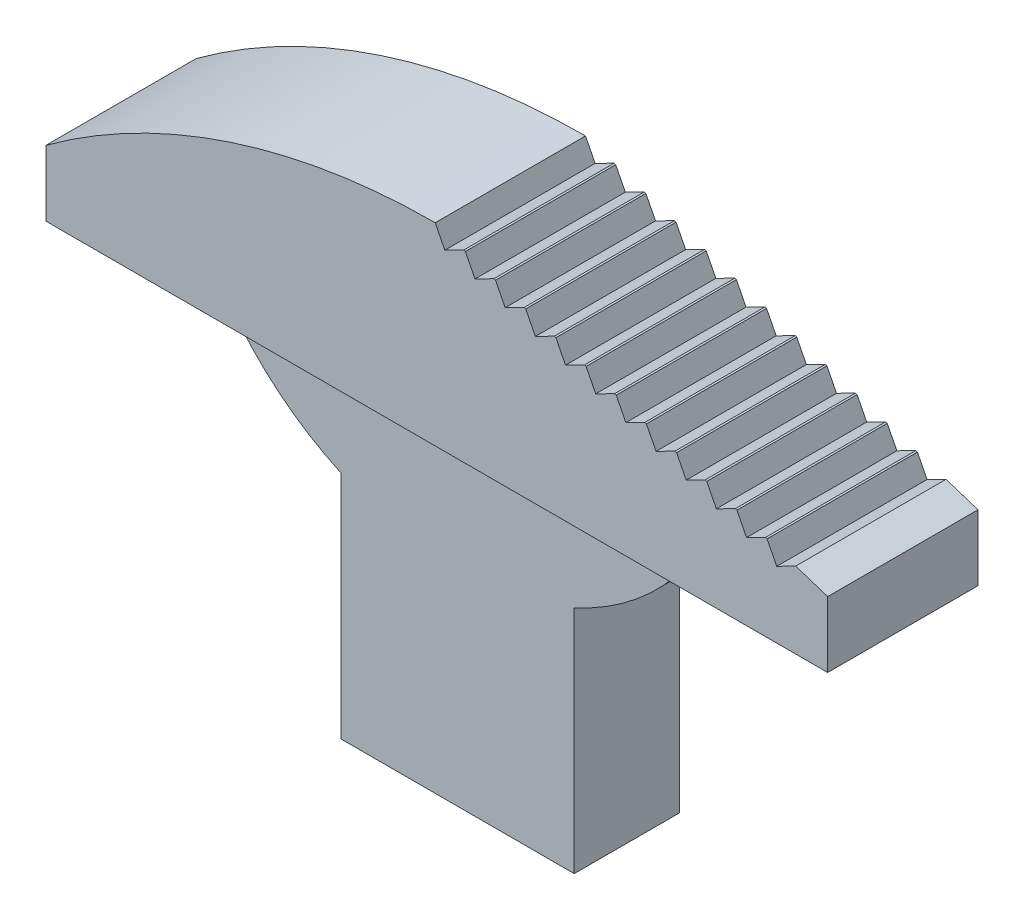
ISO-10303-21;
HEADER;
FILE_DESCRIPTION(('STEP AP214'),'2;1');
FILE_NAME('part.step','',(''),(''),'','','');
FILE_SCHEMA(('AUTOMOTIVE_DESIGN { 1 0 10303 214 1 1 1 1 }'));
ENDSEC;
DATA;
#1=APPLICATION_CONTEXT('core data for automotive mechanical design processes');
#2=APPLICATION_PROTOCOL_DEFINITION('international standard','automotive_design',2000,#1);
#3=PRODUCT_CONTEXT('',#1,'mechanical');
#4=PRODUCT('Part','Part','',(#3));
#5=PRODUCT_RELATED_PRODUCT_CATEGORY('part','',(#4));
#6=PRODUCT_DEFINITION_FORMATION('','',#4);
#7=PRODUCT_DEFINITION_CONTEXT('part definition',#1,'design');
#8=PRODUCT_DEFINITION('design','',#6,#7);
#9=PRODUCT_DEFINITION_SHAPE('','',#8);
#10=(LENGTH_UNIT() NAMED_UNIT(*) SI_UNIT(.MILLI.,.METRE.));
#11=(NAMED_UNIT(*) PLANE_ANGLE_UNIT() SI_UNIT($,.RADIAN.));
#12=(NAMED_UNIT(*) SI_UNIT($,.STERADIAN.) SOLID_ANGLE_UNIT());
#13=UNCERTAINTY_MEASURE_WITH_UNIT(LENGTH_MEASURE(1.E-05),#10,'distance_accuracy_value','');
#14=(GEOMETRIC_REPRESENTATION_CONTEXT(3) GLOBAL_UNCERTAINTY_ASSIGNED_CONTEXT((#13)) GLOBAL_UNIT_ASSIGNED_CONTEXT((#10,
#11,#12)) REPRESENTATION_CONTEXT('',''));
#15=CARTESIAN_POINT('',(0.,0.,0.));
#16=DIRECTION('',(0.,0.,1.));
#17=DIRECTION('',(1.,0.,0.));
#18=AXIS2_PLACEMENT_3D('',#15,#16,#17);
#19=CARTESIAN_POINT('',(10.5664,0.889,1.4224));
#20=DIRECTION('',(-0.309016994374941,-0.951056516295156,0.));
#21=DIRECTION('',(0.951056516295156,-0.309016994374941,0.));
#22=AXIS2_PLACEMENT_3D('',#19,#20,#21);
#23=PLANE('',#22);
#24=DIRECTION('',(0.951056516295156,-0.309016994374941,0.));
#25=VECTOR('',#24,1.);
#26=CARTESIAN_POINT('',(5.26099812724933,2.6128295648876,-0.3048));
#27=LINE('',#26,#25);
#28=CARTESIAN_POINT('',(10.1338344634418,1.0295490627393,-0.3048));
#29=VERTEX_POINT('',#28);
#30=CARTESIAN_POINT('',(10.5664,0.889,-0.3048));
#31=VERTEX_POINT('',#30);
#32=EDGE_CURVE('E350',#29,#31,#27,.T.);
#33=ORIENTED_EDGE('',*,*,#32,.F.);
#34=DIRECTION('',(0.,0.,1.));
#35=VECTOR('',#34,1.);
#36=CARTESIAN_POINT('',(10.1338344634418,1.0295490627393,-0.3048));
#37=LINE('',#36,#35);
#38=CARTESIAN_POINT('',(10.1338344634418,1.0295490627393,1.7272));
#39=VERTEX_POINT('',#38);
#40=EDGE_CURVE('E636',#29,#39,#37,.T.);
#41=ORIENTED_EDGE('',*,*,#40,.T.);
#42=DIRECTION('',(0.951056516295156,-0.309016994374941,0.));
#43=VECTOR('',#42,1.);
#44=CARTESIAN_POINT('',(5.26099812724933,2.6128295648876,1.7272));
#45=LINE('',#44,#43);
#46=CARTESIAN_POINT('',(10.5664,0.889,1.7272));
#47=VERTEX_POINT('',#46);
#48=EDGE_CURVE('E441',#39,#47,#45,.T.);
#49=ORIENTED_EDGE('',*,*,#48,.T.);
#50=DIRECTION('',(0.,0.,-1.));
#51=VECTOR('',#50,1.);
#52=CARTESIAN_POINT('',(10.5664,0.889,1.4224));
#53=LINE('',#52,#51);
#54=EDGE_CURVE('E410',#47,#31,#53,.T.);
#55=ORIENTED_EDGE('',*,*,#54,.T.);
#56=EDGE_LOOP('',(#33,#41,#49,#55));
#57=FACE_BOUND('',#56,.T.);
#58=ADVANCED_FACE('F33',(#57),#23,.F.);
#59=CARTESIAN_POINT('',(9.72598655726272,1.16206688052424,1.7272));
#60=VERTEX_POINT('',#59);
#61=CARTESIAN_POINT('',(9.74732509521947,1.15513356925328,1.7272));
#62=VERTEX_POINT('',#61);
#63=EDGE_CURVE('E342',#60,#62,#45,.T.);
#64=ORIENTED_EDGE('',*,*,#63,.T.);
#65=DIRECTION('',(0.,0.,1.));
#66=VECTOR('',#65,1.);
#67=CARTESIAN_POINT('',(9.74732509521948,1.15513356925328,-0.3048));
#68=LINE('',#67,#66);
#69=CARTESIAN_POINT('',(9.74732509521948,1.15513356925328,-0.3048));
#70=VERTEX_POINT('',#69);
#71=EDGE_CURVE('E48',#70,#62,#68,.T.);
#72=ORIENTED_EDGE('',*,*,#71,.F.);
#73=CARTESIAN_POINT('',(9.72598655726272,1.16206688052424,-0.3048));
#74=VERTEX_POINT('',#73);
#75=EDGE_CURVE('E340',#74,#70,#27,.T.);
#76=ORIENTED_EDGE('',*,*,#75,.F.);
#77=DIRECTION('',(0.,0.,1.));
#78=VECTOR('',#77,1.);
#79=CARTESIAN_POINT('',(9.72598655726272,1.16206688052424,-0.3048));
#80=LINE('',#79,#78);
#81=EDGE_CURVE('E622',#74,#60,#80,.T.);
#82=ORIENTED_EDGE('',*,*,#81,.T.);
#83=EDGE_LOOP('',(#64,#72,#76,#82));
#84=FACE_BOUND('',#83,.T.);
#85=ADVANCED_FACE('F338',(#84),#23,.F.);
#86=CARTESIAN_POINT('',(9.31813865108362,1.29458469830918,1.7272));
#87=VERTEX_POINT('',#86);
#88=CARTESIAN_POINT('',(9.33947718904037,1.28765138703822,1.7272));
#89=VERTEX_POINT('',#88);
#90=EDGE_CURVE('E720',#87,#89,#45,.T.);
#91=ORIENTED_EDGE('',*,*,#90,.T.);
#92=DIRECTION('',(0.,0.,1.));
#93=VECTOR('',#92,1.);
#94=CARTESIAN_POINT('',(9.33947718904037,1.28765138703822,-0.3048));
#95=LINE('',#94,#93);
#96=CARTESIAN_POINT('',(9.33947718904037,1.28765138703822,-0.3048));
#97=VERTEX_POINT('',#96);
#98=EDGE_CURVE('E56',#97,#89,#95,.T.);
#99=ORIENTED_EDGE('',*,*,#98,.F.);
#100=CARTESIAN_POINT('',(9.31813865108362,1.29458469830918,-0.3048));
#101=VERTEX_POINT('',#100);
#102=EDGE_CURVE('E349',#101,#97,#27,.T.);
#103=ORIENTED_EDGE('',*,*,#102,.F.);
#104=DIRECTION('',(0.,0.,1.));
#105=VECTOR('',#104,1.);
#106=CARTESIAN_POINT('',(9.31813865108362,1.29458469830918,-0.3048));
#107=LINE('',#106,#105);
#108=EDGE_CURVE('E604',#101,#87,#107,.T.);
#109=ORIENTED_EDGE('',*,*,#108,.T.);
#110=EDGE_LOOP('',(#91,#99,#103,#109));
#111=FACE_BOUND('',#110,.T.);
#112=ADVANCED_FACE('F726',(#111),#23,.F.);
#113=CARTESIAN_POINT('',(8.91029074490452,1.42710251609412,1.7272));
#114=VERTEX_POINT('',#113);
#115=CARTESIAN_POINT('',(8.93162928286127,1.42016920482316,1.7272));
#116=VERTEX_POINT('',#115);
#117=EDGE_CURVE('E712',#114,#116,#45,.T.);
#118=ORIENTED_EDGE('',*,*,#117,.T.);
#119=DIRECTION('',(0.,0.,1.));
#120=VECTOR('',#119,1.);
#121=CARTESIAN_POINT('',(8.93162928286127,1.42016920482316,-0.3048));
#122=LINE('',#121,#120);
#123=CARTESIAN_POINT('',(8.93162928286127,1.42016920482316,-0.3048));
#124=VERTEX_POINT('',#123);
#125=EDGE_CURVE('E609',#124,#116,#122,.T.);
#126=ORIENTED_EDGE('',*,*,#125,.F.);
#127=CARTESIAN_POINT('',(8.91029074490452,1.42710251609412,-0.3048));
#128=VERTEX_POINT('',#127);
#129=EDGE_CURVE('E353',#128,#124,#27,.T.);
#130=ORIENTED_EDGE('',*,*,#129,.F.);
#131=DIRECTION('',(0.,0.,1.));
#132=VECTOR('',#131,1.);
#133=CARTESIAN_POINT('',(8.91029074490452,1.42710251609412,-0.3048));
#134=LINE('',#133,#132);
#135=EDGE_CURVE('E586',#128,#114,#134,.T.);
#136=ORIENTED_EDGE('',*,*,#135,.T.);
#137=EDGE_LOOP('',(#118,#126,#130,#136));
#138=FACE_BOUND('',#137,.T.);
#139=ADVANCED_FACE('F710',(#138),#23,.F.);
#140=CARTESIAN_POINT('',(8.50244283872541,1.55962033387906,1.7272));
#141=VERTEX_POINT('',#140);
#142=CARTESIAN_POINT('',(8.52378137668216,1.55268702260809,1.7272));
#143=VERTEX_POINT('',#142);
#144=EDGE_CURVE('E732',#141,#143,#45,.T.);
#145=ORIENTED_EDGE('',*,*,#144,.T.);
#146=DIRECTION('',(0.,0.,1.));
#147=VECTOR('',#146,1.);
#148=CARTESIAN_POINT('',(8.52378137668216,1.55268702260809,-0.3048));
#149=LINE('',#148,#147);
#150=CARTESIAN_POINT('',(8.52378137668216,1.55268702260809,-0.3048));
#151=VERTEX_POINT('',#150);
#152=EDGE_CURVE('E591',#151,#143,#149,.T.);
#153=ORIENTED_EDGE('',*,*,#152,.F.);
#154=CARTESIAN_POINT('',(8.50244283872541,1.55962033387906,-0.3048));
#155=VERTEX_POINT('',#154);
#156=EDGE_CURVE('E700',#155,#151,#27,.T.);
#157=ORIENTED_EDGE('',*,*,#156,.F.);
#158=DIRECTION('',(0.,0.,1.));
#159=VECTOR('',#158,1.);
#160=CARTESIAN_POINT('',(8.50244283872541,1.55962033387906,-0.3048));
#161=LINE('',#160,#159);
#162=EDGE_CURVE('E568',#155,#141,#161,.T.);
#163=ORIENTED_EDGE('',*,*,#162,.T.);
#164=EDGE_LOOP('',(#145,#153,#157,#163));
#165=FACE_BOUND('',#164,.T.);
#166=ADVANCED_FACE('F803',(#165),#23,.F.);
#167=CARTESIAN_POINT('',(8.09459493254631,1.69213815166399,1.7272));
#168=VERTEX_POINT('',#167);
#169=CARTESIAN_POINT('',(8.11593347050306,1.68520484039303,1.7272));
#170=VERTEX_POINT('',#169);
#171=EDGE_CURVE('E734',#168,#170,#45,.T.);
#172=ORIENTED_EDGE('',*,*,#171,.T.);
#173=DIRECTION('',(0.,0.,1.));
#174=VECTOR('',#173,1.);
#175=CARTESIAN_POINT('',(8.11593347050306,1.68520484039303,-0.3048));
#176=LINE('',#175,#174);
#177=CARTESIAN_POINT('',(8.11593347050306,1.68520484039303,-0.3048));
#178=VERTEX_POINT('',#177);
#179=EDGE_CURVE('E573',#178,#170,#176,.T.);
#180=ORIENTED_EDGE('',*,*,#179,.F.);
#181=CARTESIAN_POINT('',(8.09459493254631,1.69213815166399,-0.3048));
#182=VERTEX_POINT('',#181);
#183=EDGE_CURVE('E697',#182,#178,#27,.T.);
#184=ORIENTED_EDGE('',*,*,#183,.F.);
#185=DIRECTION('',(0.,0.,1.));
#186=VECTOR('',#185,1.);
#187=CARTESIAN_POINT('',(8.09459493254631,1.69213815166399,-0.3048));
#188=LINE('',#187,#186);
#189=EDGE_CURVE('E550',#182,#168,#188,.T.);
#190=ORIENTED_EDGE('',*,*,#189,.T.);
#191=EDGE_LOOP('',(#172,#180,#184,#190));
#192=FACE_BOUND('',#191,.T.);
#193=ADVANCED_FACE('F795',(#192),#23,.F.);
#194=CARTESIAN_POINT('',(7.6867470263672,1.82465596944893,1.7272));
#195=VERTEX_POINT('',#194);
#196=CARTESIAN_POINT('',(7.70808556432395,1.81772265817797,1.7272));
#197=VERTEX_POINT('',#196);
#198=EDGE_CURVE('E739',#195,#197,#45,.T.);
#199=ORIENTED_EDGE('',*,*,#198,.T.);
#200=DIRECTION('',(0.,0.,1.));
#201=VECTOR('',#200,1.);
#202=CARTESIAN_POINT('',(7.70808556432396,1.81772265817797,-0.3048));
#203=LINE('',#202,#201);
#204=CARTESIAN_POINT('',(7.70808556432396,1.81772265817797,-0.3048));
#205=VERTEX_POINT('',#204);
#206=EDGE_CURVE('E555',#205,#197,#203,.T.);
#207=ORIENTED_EDGE('',*,*,#206,.F.);
#208=CARTESIAN_POINT('',(7.6867470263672,1.82465596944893,-0.3048));
#209=VERTEX_POINT('',#208);
#210=EDGE_CURVE('E694',#209,#205,#27,.T.);
#211=ORIENTED_EDGE('',*,*,#210,.F.);
#212=DIRECTION('',(0.,0.,1.));
#213=VECTOR('',#212,1.);
#214=CARTESIAN_POINT('',(7.6867470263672,1.82465596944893,-0.3048));
#215=LINE('',#214,#213);
#216=EDGE_CURVE('E532',#209,#195,#215,.T.);
#217=ORIENTED_EDGE('',*,*,#216,.T.);
#218=EDGE_LOOP('',(#199,#207,#211,#217));
#219=FACE_BOUND('',#218,.T.);
#220=ADVANCED_FACE('F787',(#219),#23,.F.);
#221=CARTESIAN_POINT('',(7.2788991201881,1.95717378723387,1.7272));
#222=VERTEX_POINT('',#221);
#223=CARTESIAN_POINT('',(7.30023765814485,1.95024047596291,1.7272));
#224=VERTEX_POINT('',#223);
#225=EDGE_CURVE('E744',#222,#224,#45,.T.);
#226=ORIENTED_EDGE('',*,*,#225,.T.);
#227=DIRECTION('',(0.,0.,1.));
#228=VECTOR('',#227,1.);
#229=CARTESIAN_POINT('',(7.30023765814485,1.95024047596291,-0.3048));
#230=LINE('',#229,#228);
#231=CARTESIAN_POINT('',(7.30023765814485,1.95024047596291,-0.3048));
#232=VERTEX_POINT('',#231);
#233=EDGE_CURVE('E537',#232,#224,#230,.T.);
#234=ORIENTED_EDGE('',*,*,#233,.F.);
#235=CARTESIAN_POINT('',(7.2788991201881,1.95717378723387,-0.3048));
#236=VERTEX_POINT('',#235);
#237=EDGE_CURVE('E691',#236,#232,#27,.T.);
#238=ORIENTED_EDGE('',*,*,#237,.F.);
#239=DIRECTION('',(0.,0.,1.));
#240=VECTOR('',#239,1.);
#241=CARTESIAN_POINT('',(7.2788991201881,1.95717378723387,-0.3048));
#242=LINE('',#241,#240);
#243=EDGE_CURVE('E514',#236,#222,#242,.T.);
#244=ORIENTED_EDGE('',*,*,#243,.T.);
#245=EDGE_LOOP('',(#226,#234,#238,#244));
#246=FACE_BOUND('',#245,.T.);
#247=ADVANCED_FACE('F779',(#246),#23,.F.);
#248=CARTESIAN_POINT('',(6.87105121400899,2.08969160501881,1.7272));
#249=VERTEX_POINT('',#248);
#250=CARTESIAN_POINT('',(6.89238975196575,2.08275829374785,1.7272));
#251=VERTEX_POINT('',#250);
#252=EDGE_CURVE('E749',#249,#251,#45,.T.);
#253=ORIENTED_EDGE('',*,*,#252,.T.);
#254=DIRECTION('',(0.,0.,1.));
#255=VECTOR('',#254,1.);
#256=CARTESIAN_POINT('',(6.89238975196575,2.08275829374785,-0.3048));
#257=LINE('',#256,#255);
#258=CARTESIAN_POINT('',(6.89238975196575,2.08275829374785,-0.3048));
#259=VERTEX_POINT('',#258);
#260=EDGE_CURVE('E519',#259,#251,#257,.T.);
#261=ORIENTED_EDGE('',*,*,#260,.F.);
#262=CARTESIAN_POINT('',(6.87105121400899,2.08969160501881,-0.3048));
#263=VERTEX_POINT('',#262);
#264=EDGE_CURVE('E688',#263,#259,#27,.T.);
#265=ORIENTED_EDGE('',*,*,#264,.F.);
#266=DIRECTION('',(0.,0.,1.));
#267=VECTOR('',#266,1.);
#268=CARTESIAN_POINT('',(6.87105121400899,2.08969160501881,-0.3048));
#269=LINE('',#268,#267);
#270=EDGE_CURVE('E496',#263,#249,#269,.T.);
#271=ORIENTED_EDGE('',*,*,#270,.T.);
#272=EDGE_LOOP('',(#253,#261,#265,#271));
#273=FACE_BOUND('',#272,.T.);
#274=ADVANCED_FACE('F770',(#273),#23,.F.);
#275=CARTESIAN_POINT('',(6.46320330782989,2.22220942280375,1.7272));
#276=VERTEX_POINT('',#275);
#277=CARTESIAN_POINT('',(6.48454184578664,2.21527611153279,1.7272));
#278=VERTEX_POINT('',#277);
#279=EDGE_CURVE('E754',#276,#278,#45,.T.);
#280=ORIENTED_EDGE('',*,*,#279,.T.);
#281=DIRECTION('',(0.,0.,1.));
#282=VECTOR('',#281,1.);
#283=CARTESIAN_POINT('',(6.48454184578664,2.21527611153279,-0.3048));
#284=LINE('',#283,#282);
#285=CARTESIAN_POINT('',(6.48454184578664,2.21527611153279,-0.3048));
#286=VERTEX_POINT('',#285);
#287=EDGE_CURVE('E501',#286,#278,#284,.T.);
#288=ORIENTED_EDGE('',*,*,#287,.F.);
#289=CARTESIAN_POINT('',(6.46320330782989,2.22220942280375,-0.3048));
#290=VERTEX_POINT('',#289);
#291=EDGE_CURVE('E686',#290,#286,#27,.T.);
#292=ORIENTED_EDGE('',*,*,#291,.F.);
#293=DIRECTION('',(0.,0.,1.));
#294=VECTOR('',#293,1.);
#295=CARTESIAN_POINT('',(6.46320330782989,2.22220942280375,-0.3048));
#296=LINE('',#295,#294);
#297=EDGE_CURVE('E478',#290,#276,#296,.T.);
#298=ORIENTED_EDGE('',*,*,#297,.T.);
#299=EDGE_LOOP('',(#280,#288,#292,#298));
#300=FACE_BOUND('',#299,.T.);
#301=ADVANCED_FACE('F762',(#300),#23,.F.);
#302=CARTESIAN_POINT('',(6.05535540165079,2.35472724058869,1.7272));
#303=VERTEX_POINT('',#302);
#304=CARTESIAN_POINT('',(6.07669393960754,2.34779392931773,1.7272));
#305=VERTEX_POINT('',#304);
#306=EDGE_CURVE('E440',#303,#305,#45,.T.);
#307=ORIENTED_EDGE('',*,*,#306,.T.);
#308=DIRECTION('',(0.,0.,1.));
#309=VECTOR('',#308,1.);
#310=CARTESIAN_POINT('',(6.07669393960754,2.34779392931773,-0.3048));
#311=LINE('',#310,#309);
#312=CARTESIAN_POINT('',(6.07669393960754,2.34779392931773,-0.3048));
#313=VERTEX_POINT('',#312);
#314=EDGE_CURVE('E483',#313,#305,#311,.T.);
#315=ORIENTED_EDGE('',*,*,#314,.F.);
#316=CARTESIAN_POINT('',(6.05535540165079,2.35472724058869,-0.3048));
#317=VERTEX_POINT('',#316);
#318=EDGE_CURVE('E360',#317,#313,#27,.T.);
#319=ORIENTED_EDGE('',*,*,#318,.F.);
#320=DIRECTION('',(0.,0.,1.));
#321=VECTOR('',#320,1.);
#322=CARTESIAN_POINT('',(6.05535540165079,2.35472724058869,-0.3048));
#323=LINE('',#322,#321);
#324=EDGE_CURVE('E461',#317,#303,#323,.T.);
#325=ORIENTED_EDGE('',*,*,#324,.T.);
#326=EDGE_LOOP('',(#307,#315,#319,#325));
#327=FACE_BOUND('',#326,.T.);
#328=ADVANCED_FACE('F683',(#327),#23,.F.);
#329=CARTESIAN_POINT('',(0.,0.,1.4224));
#330=DIRECTION('',(-1.,0.,0.));
#331=DIRECTION('',(0.,0.,1.));
#332=AXIS2_PLACEMENT_3D('',#329,#330,#331);
#333=PLANE('',#332);
#334=DIRECTION('',(0.,0.,-1.));
#335=VECTOR('',#334,1.);
#336=CARTESIAN_POINT('',(0.,0.889000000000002,1.4224));
#337=LINE('',#336,#335);
#338=CARTESIAN_POINT('',(0.,0.889000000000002,1.7272));
#339=VERTEX_POINT('',#338);
#340=CARTESIAN_POINT('',(0.,0.889000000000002,-0.3048));
#341=VERTEX_POINT('',#340);
#342=EDGE_CURVE('E379',#339,#341,#337,.T.);
#343=ORIENTED_EDGE('',*,*,#342,.T.);
#344=DIRECTION('',(0.,1.,0.));
#345=VECTOR('',#344,1.);
#346=CARTESIAN_POINT('',(0.,0.,-0.3048));
#347=LINE('',#346,#345);
#348=CARTESIAN_POINT('',(0.,0.,-0.3048));
#349=VERTEX_POINT('',#348);
#350=EDGE_CURVE('E420',#349,#341,#347,.T.);
#351=ORIENTED_EDGE('',*,*,#350,.F.);
#352=DIRECTION('',(0.,0.,-1.));
#353=VECTOR('',#352,1.);
#354=CARTESIAN_POINT('',(0.,0.,1.4224));
#355=LINE('',#354,#353);
#356=CARTESIAN_POINT('',(0.,0.,1.7272));
#357=VERTEX_POINT('',#356);
#358=EDGE_CURVE('E41',#357,#349,#355,.T.);
#359=ORIENTED_EDGE('',*,*,#358,.F.);
#360=DIRECTION('',(0.,1.,0.));
#361=VECTOR('',#360,1.);
#362=CARTESIAN_POINT('',(0.,0.,1.7272));
#363=LINE('',#362,#361);
#364=EDGE_CURVE('E423',#357,#339,#363,.T.);
#365=ORIENTED_EDGE('',*,*,#364,.T.);
#366=EDGE_LOOP('',(#343,#351,#359,#365));
#367=FACE_BOUND('',#366,.T.);
#368=ADVANCED_FACE('F35',(#367),#333,.T.);
#369=CARTESIAN_POINT('',(0.,0.,1.4224));
#370=DIRECTION('',(0.,1.,0.));
#371=DIRECTION('',(0.,0.,1.));
#372=AXIS2_PLACEMENT_3D('',#369,#370,#371);
#373=PLANE('',#372);
#374=DIRECTION('',(0.,0.,-1.));
#375=VECTOR('',#374,1.);
#376=CARTESIAN_POINT('',(10.5664,0.,1.4224));
#377=LINE('',#376,#375);
#378=CARTESIAN_POINT('',(10.5664,0.,1.7272));
#379=VERTEX_POINT('',#378);
#380=CARTESIAN_POINT('',(10.5664,0.,-0.3048));
#381=VERTEX_POINT('',#380);
#382=EDGE_CURVE('E408',#379,#381,#377,.T.);
#383=ORIENTED_EDGE('',*,*,#382,.F.);
#384=DIRECTION('',(-1.,0.,0.));
#385=VECTOR('',#384,1.);
#386=CARTESIAN_POINT('',(10.5664,0.,1.7272));
#387=LINE('',#386,#385);
#388=EDGE_CURVE('E445',#379,#357,#387,.T.);
#389=ORIENTED_EDGE('',*,*,#388,.T.);
#390=ORIENTED_EDGE('',*,*,#358,.T.);
#391=DIRECTION('',(-1.,0.,0.));
#392=VECTOR('',#391,1.);
#393=CARTESIAN_POINT('',(10.5664,0.,-0.3048));
#394=LINE('',#393,#392);
#395=EDGE_CURVE('E432',#381,#349,#394,.T.);
#396=ORIENTED_EDGE('',*,*,#395,.F.);
#397=EDGE_LOOP('',(#383,#389,#390,#396));
#398=FACE_BOUND('',#397,.T.);
#399=DIRECTION('',(-1.,0.,0.));
#400=VECTOR('',#399,1.);
#401=CARTESIAN_POINT('',(5.26099812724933,0.,1.4224));
#402=LINE('',#401,#400);
#403=CARTESIAN_POINT('',(8.36468689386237,0.,1.4224));
#404=VERTEX_POINT('',#403);
#405=CARTESIAN_POINT('',(2.15730936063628,0.,1.4224));
#406=VERTEX_POINT('',#405);
#407=EDGE_CURVE('E362',#404,#406,#402,.T.);
#408=ORIENTED_EDGE('',*,*,#407,.F.);
#409=DIRECTION('',(0.,0.,-1.));
#410=VECTOR('',#409,1.);
#411=CARTESIAN_POINT('',(8.36468689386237,0.,1.4224));
#412=LINE('',#411,#410);
#413=CARTESIAN_POINT('',(8.36468689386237,0.,0.));
#414=VERTEX_POINT('',#413);
#415=EDGE_CURVE('E405',#404,#414,#412,.T.);
#416=ORIENTED_EDGE('',*,*,#415,.T.);
#417=DIRECTION('',(-1.,0.,0.));
#418=VECTOR('',#417,1.);
#419=CARTESIAN_POINT('',(5.26099812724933,0.,0.));
#420=LINE('',#419,#418);
#421=CARTESIAN_POINT('',(2.15730936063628,0.,0.));
#422=VERTEX_POINT('',#421);
#423=EDGE_CURVE('E11',#414,#422,#420,.T.);
#424=ORIENTED_EDGE('',*,*,#423,.T.);
#425=DIRECTION('',(0.,0.,-1.));
#426=VECTOR('',#425,1.);
#427=CARTESIAN_POINT('',(2.15730936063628,0.,1.4224));
#428=LINE('',#427,#426);
#429=EDGE_CURVE('E392',#406,#422,#428,.T.);
#430=ORIENTED_EDGE('',*,*,#429,.F.);
#431=EDGE_LOOP('',(#408,#416,#424,#430));
#432=FACE_BOUND('',#431,.T.);
#433=ADVANCED_FACE('F656',(#398,#432),#373,.F.);
#434=CARTESIAN_POINT('',(5.26099812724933,2.2098,1.4224));
#435=DIRECTION('',(0.,0.,-1.));
#436=DIRECTION('',(-1.,0.,0.));
#437=AXIS2_PLACEMENT_3D('',#434,#435,#436);
#438=CYLINDRICAL_SURFACE('',#437,3.81);
#439=CARTESIAN_POINT('',(5.26099812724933,2.2098,0.));
#440=DIRECTION('',(0.,0.,1.));
#441=DIRECTION('',(1.,0.,0.));
#442=AXIS2_PLACEMENT_3D('',#439,#440,#441);
#443=CIRCLE('',#442,3.81);
#444=CARTESIAN_POINT('',(3.68619812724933,-1.25950900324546,0.));
#445=VERTEX_POINT('',#444);
#446=EDGE_CURVE('E370',#422,#445,#443,.T.);
#447=ORIENTED_EDGE('',*,*,#446,.T.);
#448=DIRECTION('',(0.,0.,-1.));
#449=VECTOR('',#448,1.);
#450=CARTESIAN_POINT('',(3.68619812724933,-1.25950900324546,1.4224));
#451=LINE('',#450,#449);
#452=CARTESIAN_POINT('',(3.68619812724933,-1.25950900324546,1.4224));
#453=VERTEX_POINT('',#452);
#454=EDGE_CURVE('E395',#453,#445,#451,.T.);
#455=ORIENTED_EDGE('',*,*,#454,.F.);
#456=CARTESIAN_POINT('',(5.26099812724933,2.2098,1.4224));
#457=DIRECTION('',(0.,0.,1.));
#458=DIRECTION('',(1.,0.,0.));
#459=AXIS2_PLACEMENT_3D('',#456,#457,#458);
#460=CIRCLE('',#459,3.81);
#461=EDGE_CURVE('E377',#406,#453,#460,.T.);
#462=ORIENTED_EDGE('',*,*,#461,.F.);
#463=ORIENTED_EDGE('',*,*,#429,.T.);
#464=EDGE_LOOP('',(#447,#455,#462,#463));
#465=FACE_BOUND('',#464,.T.);
#466=ADVANCED_FACE('F917',(#465),#438,.T.);
#467=CARTESIAN_POINT('',(3.68619812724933,-4.3721704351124,1.4224));
#468=DIRECTION('',(-1.,0.,0.));
#469=DIRECTION('',(0.,0.,1.));
#470=AXIS2_PLACEMENT_3D('',#467,#468,#469);
#471=PLANE('',#470);
#472=DIRECTION('',(0.,1.,0.));
#473=VECTOR('',#472,1.);
#474=CARTESIAN_POINT('',(3.68619812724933,-4.3721704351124,0.));
#475=LINE('',#474,#473);
#476=CARTESIAN_POINT('',(3.68619812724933,-4.3721704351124,0.));
#477=VERTEX_POINT('',#476);
#478=EDGE_CURVE('E386',#477,#445,#475,.T.);
#479=ORIENTED_EDGE('',*,*,#478,.F.);
#480=DIRECTION('',(0.,0.,-1.));
#481=VECTOR('',#480,1.);
#482=CARTESIAN_POINT('',(3.68619812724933,-4.3721704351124,1.4224));
#483=LINE('',#482,#481);
#484=CARTESIAN_POINT('',(3.68619812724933,-4.3721704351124,1.4224));
#485=VERTEX_POINT('',#484);
#486=EDGE_CURVE('E397',#485,#477,#483,.T.);
#487=ORIENTED_EDGE('',*,*,#486,.F.);
#488=DIRECTION('',(0.,1.,0.));
#489=VECTOR('',#488,1.);
#490=CARTESIAN_POINT('',(3.68619812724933,-4.3721704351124,1.4224));
#491=LINE('',#490,#489);
#492=EDGE_CURVE('E374',#485,#453,#491,.T.);
#493=ORIENTED_EDGE('',*,*,#492,.T.);
#494=ORIENTED_EDGE('',*,*,#454,.T.);
#495=EDGE_LOOP('',(#479,#487,#493,#494));
#496=FACE_BOUND('',#495,.T.);
#497=ADVANCED_FACE('F922',(#496),#471,.T.);
#498=CARTESIAN_POINT('',(3.68619812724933,-4.3721704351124,1.4224));
#499=DIRECTION('',(0.,1.,0.));
#500=DIRECTION('',(0.,0.,1.));
#501=AXIS2_PLACEMENT_3D('',#498,#499,#500);
#502=PLANE('',#501);
#503=DIRECTION('',(1.,0.,0.));
#504=VECTOR('',#503,1.);
#505=CARTESIAN_POINT('',(3.68619812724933,-4.3721704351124,0.));
#506=LINE('',#505,#504);
#507=CARTESIAN_POINT('',(6.83579812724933,-4.3721704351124,0.));
#508=VERTEX_POINT('',#507);
#509=EDGE_CURVE('E384',#477,#508,#506,.T.);
#510=ORIENTED_EDGE('',*,*,#509,.T.);
#511=DIRECTION('',(0.,0.,-1.));
#512=VECTOR('',#511,1.);
#513=CARTESIAN_POINT('',(6.83579812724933,-4.3721704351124,1.4224));
#514=LINE('',#513,#512);
#515=CARTESIAN_POINT('',(6.83579812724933,-4.3721704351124,1.4224));
#516=VERTEX_POINT('',#515);
#517=EDGE_CURVE('E399',#516,#508,#514,.T.);
#518=ORIENTED_EDGE('',*,*,#517,.F.);
#519=DIRECTION('',(1.,0.,0.));
#520=VECTOR('',#519,1.);
#521=CARTESIAN_POINT('',(3.68619812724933,-4.3721704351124,1.4224));
#522=LINE('',#521,#520);
#523=EDGE_CURVE('E372',#485,#516,#522,.T.);
#524=ORIENTED_EDGE('',*,*,#523,.F.);
#525=ORIENTED_EDGE('',*,*,#486,.T.);
#526=EDGE_LOOP('',(#510,#518,#524,#525));
#527=FACE_BOUND('',#526,.T.);
#528=ADVANCED_FACE('F947',(#527),#502,.F.);
#529=CARTESIAN_POINT('',(6.83579812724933,-4.3721704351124,1.4224));
#530=DIRECTION('',(-1.,0.,0.));
#531=DIRECTION('',(0.,0.,1.));
#532=AXIS2_PLACEMENT_3D('',#529,#530,#531);
#533=PLANE('',#532);
#534=DIRECTION('',(0.,1.,0.));
#535=VECTOR('',#534,1.);
#536=CARTESIAN_POINT('',(6.83579812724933,-4.3721704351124,0.));
#537=LINE('',#536,#535);
#538=CARTESIAN_POINT('',(6.83579812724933,-1.25950900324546,0.));
#539=VERTEX_POINT('',#538);
#540=EDGE_CURVE('E382',#508,#539,#537,.T.);
#541=ORIENTED_EDGE('',*,*,#540,.T.);
#542=DIRECTION('',(0.,0.,-1.));
#543=VECTOR('',#542,1.);
#544=CARTESIAN_POINT('',(6.83579812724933,-1.25950900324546,1.4224));
#545=LINE('',#544,#543);
#546=CARTESIAN_POINT('',(6.83579812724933,-1.25950900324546,1.4224));
#547=VERTEX_POINT('',#546);
#548=EDGE_CURVE('E402',#547,#539,#545,.T.);
#549=ORIENTED_EDGE('',*,*,#548,.F.);
#550=DIRECTION('',(0.,1.,0.));
#551=VECTOR('',#550,1.);
#552=CARTESIAN_POINT('',(6.83579812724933,-4.3721704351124,1.4224));
#553=LINE('',#552,#551);
#554=EDGE_CURVE('E369',#516,#547,#553,.T.);
#555=ORIENTED_EDGE('',*,*,#554,.F.);
#556=ORIENTED_EDGE('',*,*,#517,.T.);
#557=EDGE_LOOP('',(#541,#549,#555,#556));
#558=FACE_BOUND('',#557,.T.);
#559=ADVANCED_FACE('F909',(#558),#533,.F.);
#560=CARTESIAN_POINT('',(5.26099812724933,2.2098,1.4224));
#561=DIRECTION('',(0.,0.,-1.));
#562=DIRECTION('',(-1.,0.,0.));
#563=AXIS2_PLACEMENT_3D('',#560,#561,#562);
#564=CYLINDRICAL_SURFACE('',#563,3.81);
#565=CARTESIAN_POINT('',(5.26099812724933,2.2098,0.));
#566=DIRECTION('',(0.,0.,1.));
#567=DIRECTION('',(1.,0.,0.));
#568=AXIS2_PLACEMENT_3D('',#565,#566,#567);
#569=CIRCLE('',#568,3.81);
#570=EDGE_CURVE('E365',#539,#414,#569,.T.);
#571=ORIENTED_EDGE('',*,*,#570,.T.);
#572=ORIENTED_EDGE('',*,*,#415,.F.);
#573=CARTESIAN_POINT('',(5.26099812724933,2.2098,1.4224));
#574=DIRECTION('',(0.,0.,1.));
#575=DIRECTION('',(1.,0.,0.));
#576=AXIS2_PLACEMENT_3D('',#573,#574,#575);
#577=CIRCLE('',#576,3.81);
#578=EDGE_CURVE('E367',#547,#404,#577,.T.);
#579=ORIENTED_EDGE('',*,*,#578,.F.);
#580=ORIENTED_EDGE('',*,*,#548,.T.);
#581=EDGE_LOOP('',(#571,#572,#579,#580));
#582=FACE_BOUND('',#581,.T.);
#583=ADVANCED_FACE('F829',(#582),#564,.T.);
#584=CARTESIAN_POINT('',(10.5664,0.,1.4224));
#585=DIRECTION('',(-1.,0.,0.));
#586=DIRECTION('',(0.,0.,1.));
#587=AXIS2_PLACEMENT_3D('',#584,#585,#586);
#588=PLANE('',#587);
#589=ORIENTED_EDGE('',*,*,#382,.T.);
#590=DIRECTION('',(0.,-1.,0.));
#591=VECTOR('',#590,1.);
#592=CARTESIAN_POINT('',(10.5664,0.889,-0.3048));
#593=LINE('',#592,#591);
#594=EDGE_CURVE('E433',#31,#381,#593,.T.);
#595=ORIENTED_EDGE('',*,*,#594,.F.);
#596=ORIENTED_EDGE('',*,*,#54,.F.);
#597=DIRECTION('',(0.,-1.,0.));
#598=VECTOR('',#597,1.);
#599=CARTESIAN_POINT('',(10.5664,0.889,1.7272));
#600=LINE('',#599,#598);
#601=EDGE_CURVE('E359',#47,#379,#600,.T.);
#602=ORIENTED_EDGE('',*,*,#601,.T.);
#603=EDGE_LOOP('',(#589,#595,#596,#602));
#604=FACE_BOUND('',#603,.T.);
#605=ADVANCED_FACE('F653',(#604),#588,.F.);
#606=CARTESIAN_POINT('',(5.64750749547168,2.48724505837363,1.7272));
#607=VERTEX_POINT('',#606);
#608=CARTESIAN_POINT('',(5.66884603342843,2.48031174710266,1.7272));
#609=VERTEX_POINT('',#608);
#610=EDGE_CURVE('E366',#607,#609,#45,.T.);
#611=ORIENTED_EDGE('',*,*,#610,.T.);
#612=DIRECTION('',(0.,0.,1.));
#613=VECTOR('',#612,1.);
#614=CARTESIAN_POINT('',(5.66884603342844,2.48031174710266,-0.3048));
#615=LINE('',#614,#613);
#616=CARTESIAN_POINT('',(5.66884603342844,2.48031174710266,-0.3048));
#617=VERTEX_POINT('',#616);
#618=EDGE_CURVE('E465',#617,#609,#615,.T.);
#619=ORIENTED_EDGE('',*,*,#618,.F.);
#620=CARTESIAN_POINT('',(5.64750749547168,2.48724505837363,-0.3048));
#621=VERTEX_POINT('',#620);
#622=EDGE_CURVE('E355',#621,#617,#27,.T.);
#623=ORIENTED_EDGE('',*,*,#622,.F.);
#624=DIRECTION('',(0.,0.,1.));
#625=VECTOR('',#624,1.);
#626=CARTESIAN_POINT('',(5.64750749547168,2.48724505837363,-0.3048));
#627=LINE('',#626,#625);
#628=EDGE_CURVE('E437',#621,#607,#627,.T.);
#629=ORIENTED_EDGE('',*,*,#628,.T.);
#630=EDGE_LOOP('',(#611,#619,#623,#629));
#631=FACE_BOUND('',#630,.T.);
#632=ADVANCED_FACE('F670',(#631),#23,.F.);
#633=CARTESIAN_POINT('',(5.26099812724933,-6.2771704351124,1.4224));
#634=DIRECTION('',(0.,0.,-1.));
#635=DIRECTION('',(-1.,0.,0.));
#636=AXIS2_PLACEMENT_3D('',#633,#634,#635);
#637=CYLINDRICAL_SURFACE('',#636,8.89);
#638=DIRECTION('',(0.,0.,-1.));
#639=VECTOR('',#638,1.);
#640=CARTESIAN_POINT('',(5.26099812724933,2.6128295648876,1.4224));
#641=LINE('',#640,#639);
#642=CARTESIAN_POINT('',(5.26099812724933,2.6128295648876,1.7272));
#643=VERTEX_POINT('',#642);
#644=CARTESIAN_POINT('',(5.26099812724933,2.6128295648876,-0.3048));
#645=VERTEX_POINT('',#644);
#646=EDGE_CURVE('E413',#643,#645,#641,.T.);
#647=ORIENTED_EDGE('',*,*,#646,.T.);
#648=CARTESIAN_POINT('',(5.26099812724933,-6.2771704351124,-0.3048));
#649=DIRECTION('',(0.,0.,-1.));
#650=DIRECTION('',(-1.,0.,0.));
#651=AXIS2_PLACEMENT_3D('',#648,#649,#650);
#652=CIRCLE('',#651,8.89);
#653=EDGE_CURVE('E354',#341,#645,#652,.T.);
#654=ORIENTED_EDGE('',*,*,#653,.F.);
#655=ORIENTED_EDGE('',*,*,#342,.F.);
#656=CARTESIAN_POINT('',(5.26099812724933,-6.2771704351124,1.7272));
#657=DIRECTION('',(0.,0.,-1.));
#658=DIRECTION('',(-1.,0.,0.));
#659=AXIS2_PLACEMENT_3D('',#656,#657,#658);
#660=CIRCLE('',#659,8.89);
#661=EDGE_CURVE('E442',#339,#643,#660,.T.);
#662=ORIENTED_EDGE('',*,*,#661,.T.);
#663=EDGE_LOOP('',(#647,#654,#655,#662));
#664=FACE_BOUND('',#663,.T.);
#665=ADVANCED_FACE('F428',(#664),#637,.T.);
#666=CARTESIAN_POINT('',(5.26099812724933,-6.2771704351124,1.4224));
#667=DIRECTION('',(0.,0.,-1.));
#668=DIRECTION('',(-1.,0.,0.));
#669=AXIS2_PLACEMENT_3D('',#666,#667,#668);
#670=PLANE('',#669);
#671=ORIENTED_EDGE('',*,*,#578,.T.);
#672=ORIENTED_EDGE('',*,*,#407,.T.);
#673=ORIENTED_EDGE('',*,*,#461,.T.);
#674=ORIENTED_EDGE('',*,*,#492,.F.);
#675=ORIENTED_EDGE('',*,*,#523,.T.);
#676=ORIENTED_EDGE('',*,*,#554,.T.);
#677=EDGE_LOOP('',(#671,#672,#673,#674,#675,#676));
#678=FACE_BOUND('',#677,.T.);
#679=ADVANCED_FACE('F828',(#678),#670,.F.);
#680=CARTESIAN_POINT('',(5.26099812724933,-6.2771704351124,0.));
#681=DIRECTION('',(0.,0.,-1.));
#682=DIRECTION('',(-1.,0.,0.));
#683=AXIS2_PLACEMENT_3D('',#680,#681,#682);
#684=PLANE('',#683);
#685=ORIENTED_EDGE('',*,*,#423,.F.);
#686=ORIENTED_EDGE('',*,*,#570,.F.);
#687=ORIENTED_EDGE('',*,*,#540,.F.);
#688=ORIENTED_EDGE('',*,*,#509,.F.);
#689=ORIENTED_EDGE('',*,*,#478,.T.);
#690=ORIENTED_EDGE('',*,*,#446,.F.);
#691=EDGE_LOOP('',(#685,#686,#687,#688,#689,#690));
#692=FACE_BOUND('',#691,.T.);
#693=ADVANCED_FACE('F874',(#692),#684,.T.);
#694=CARTESIAN_POINT('',(5.26099812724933,-6.2771704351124,-0.3048));
#695=DIRECTION('',(0.,0.,-1.));
#696=DIRECTION('',(-1.,0.,0.));
#697=AXIS2_PLACEMENT_3D('',#694,#695,#696);
#698=PLANE('',#697);
#699=DIRECTION('',(0.891006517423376,0.45399051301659,0.));
#700=VECTOR('',#699,1.);
#701=CARTESIAN_POINT('',(9.8777875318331,0.899086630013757,-0.3048));
#702=LINE('',#701,#700);
#703=CARTESIAN_POINT('',(9.8777875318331,0.899086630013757,-0.3048));
#704=VERTEX_POINT('',#703);
#705=EDGE_CURVE('E332',#704,#29,#702,.T.);
#706=ORIENTED_EDGE('',*,*,#705,.T.);
#707=ORIENTED_EDGE('',*,*,#32,.T.);
#708=ORIENTED_EDGE('',*,*,#594,.T.);
#709=ORIENTED_EDGE('',*,*,#395,.T.);
#710=ORIENTED_EDGE('',*,*,#350,.T.);
#711=ORIENTED_EDGE('',*,*,#653,.T.);
#712=DIRECTION('',(0.453990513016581,-0.891006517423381,0.));
#713=VECTOR('',#712,1.);
#714=CARTESIAN_POINT('',(5.26099812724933,2.6128295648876,-0.3048));
#715=LINE('',#714,#713);
#716=CARTESIAN_POINT('',(5.39146056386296,2.35678262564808,-0.3048));
#717=VERTEX_POINT('',#716);
#718=EDGE_CURVE('E457',#645,#717,#715,.T.);
#719=ORIENTED_EDGE('',*,*,#718,.T.);
#720=DIRECTION('',(0.891006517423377,0.453990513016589,0.));
#721=VECTOR('',#720,1.);
#722=CARTESIAN_POINT('',(5.39146056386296,2.35678262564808,-0.3048));
#723=LINE('',#722,#721);
#724=EDGE_CURVE('E452',#717,#621,#723,.T.);
#725=ORIENTED_EDGE('',*,*,#724,.T.);
#726=ORIENTED_EDGE('',*,*,#622,.T.);
#727=DIRECTION('',(0.453990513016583,-0.89100651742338,0.));
#728=VECTOR('',#727,1.);
#729=CARTESIAN_POINT('',(5.66884603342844,2.48031174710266,-0.3048));
#730=LINE('',#729,#728);
#731=CARTESIAN_POINT('',(5.79930847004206,2.22426480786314,-0.3048));
#732=VERTEX_POINT('',#731);
#733=EDGE_CURVE('E474',#617,#732,#730,.T.);
#734=ORIENTED_EDGE('',*,*,#733,.T.);
#735=DIRECTION('',(0.891006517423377,0.453990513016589,0.));
#736=VECTOR('',#735,1.);
#737=CARTESIAN_POINT('',(5.79930847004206,2.22426480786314,-0.3048));
#738=LINE('',#737,#736);
#739=EDGE_CURVE('E468',#732,#317,#738,.T.);
#740=ORIENTED_EDGE('',*,*,#739,.T.);
#741=ORIENTED_EDGE('',*,*,#318,.T.);
#742=DIRECTION('',(0.453990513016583,-0.89100651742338,0.));
#743=VECTOR('',#742,1.);
#744=CARTESIAN_POINT('',(6.07669393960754,2.34779392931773,-0.3048));
#745=LINE('',#744,#743);
#746=CARTESIAN_POINT('',(6.20715637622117,2.0917469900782,-0.3048));
#747=VERTEX_POINT('',#746);
#748=EDGE_CURVE('E492',#313,#747,#745,.T.);
#749=ORIENTED_EDGE('',*,*,#748,.T.);
#750=DIRECTION('',(0.891006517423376,0.45399051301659,0.));
#751=VECTOR('',#750,1.);
#752=CARTESIAN_POINT('',(6.20715637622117,2.0917469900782,-0.3048));
#753=LINE('',#752,#751);
#754=EDGE_CURVE('E486',#747,#290,#753,.T.);
#755=ORIENTED_EDGE('',*,*,#754,.T.);
#756=ORIENTED_EDGE('',*,*,#291,.T.);
#757=DIRECTION('',(0.453990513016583,-0.89100651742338,0.));
#758=VECTOR('',#757,1.);
#759=CARTESIAN_POINT('',(6.48454184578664,2.21527611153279,-0.3048));
#760=LINE('',#759,#758);
#761=CARTESIAN_POINT('',(6.61500428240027,1.95922917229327,-0.3048));
#762=VERTEX_POINT('',#761);
#763=EDGE_CURVE('E510',#286,#762,#760,.T.);
#764=ORIENTED_EDGE('',*,*,#763,.T.);
#765=DIRECTION('',(0.891006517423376,0.45399051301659,0.));
#766=VECTOR('',#765,1.);
#767=CARTESIAN_POINT('',(6.61500428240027,1.95922917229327,-0.3048));
#768=LINE('',#767,#766);
#769=EDGE_CURVE('E504',#762,#263,#768,.T.);
#770=ORIENTED_EDGE('',*,*,#769,.T.);
#771=ORIENTED_EDGE('',*,*,#264,.T.);
#772=DIRECTION('',(0.453990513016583,-0.89100651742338,0.));
#773=VECTOR('',#772,1.);
#774=CARTESIAN_POINT('',(6.89238975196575,2.08275829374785,-0.3048));
#775=LINE('',#774,#773);
#776=CARTESIAN_POINT('',(7.02285218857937,1.82671135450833,-0.3048));
#777=VERTEX_POINT('',#776);
#778=EDGE_CURVE('E528',#259,#777,#775,.T.);
#779=ORIENTED_EDGE('',*,*,#778,.T.);
#780=DIRECTION('',(0.891006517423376,0.45399051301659,0.));
#781=VECTOR('',#780,1.);
#782=CARTESIAN_POINT('',(7.02285218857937,1.82671135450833,-0.3048));
#783=LINE('',#782,#781);
#784=EDGE_CURVE('E522',#777,#236,#783,.T.);
#785=ORIENTED_EDGE('',*,*,#784,.T.);
#786=ORIENTED_EDGE('',*,*,#237,.T.);
#787=DIRECTION('',(0.45399051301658,-0.891006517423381,0.));
#788=VECTOR('',#787,1.);
#789=CARTESIAN_POINT('',(7.30023765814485,1.95024047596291,-0.3048));
#790=LINE('',#789,#788);
#791=CARTESIAN_POINT('',(7.43070009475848,1.69419353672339,-0.3048));
#792=VERTEX_POINT('',#791);
#793=EDGE_CURVE('E546',#232,#792,#790,.T.);
#794=ORIENTED_EDGE('',*,*,#793,.T.);
#795=DIRECTION('',(0.891006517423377,0.453990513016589,0.));
#796=VECTOR('',#795,1.);
#797=CARTESIAN_POINT('',(7.43070009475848,1.69419353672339,-0.3048));
#798=LINE('',#797,#796);
#799=EDGE_CURVE('E540',#792,#209,#798,.T.);
#800=ORIENTED_EDGE('',*,*,#799,.T.);
#801=ORIENTED_EDGE('',*,*,#210,.T.);
#802=DIRECTION('',(0.453990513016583,-0.89100651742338,0.));
#803=VECTOR('',#802,1.);
#804=CARTESIAN_POINT('',(7.70808556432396,1.81772265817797,-0.3048));
#805=LINE('',#804,#803);
#806=CARTESIAN_POINT('',(7.83854800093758,1.56167571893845,-0.3048));
#807=VERTEX_POINT('',#806);
#808=EDGE_CURVE('E564',#205,#807,#805,.T.);
#809=ORIENTED_EDGE('',*,*,#808,.T.);
#810=DIRECTION('',(0.891006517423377,0.453990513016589,0.));
#811=VECTOR('',#810,1.);
#812=CARTESIAN_POINT('',(7.83854800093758,1.56167571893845,-0.3048));
#813=LINE('',#812,#811);
#814=EDGE_CURVE('E558',#807,#182,#813,.T.);
#815=ORIENTED_EDGE('',*,*,#814,.T.);
#816=ORIENTED_EDGE('',*,*,#183,.T.);
#817=DIRECTION('',(0.453990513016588,-0.891006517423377,0.));
#818=VECTOR('',#817,1.);
#819=CARTESIAN_POINT('',(8.11593347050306,1.68520484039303,-0.3048));
#820=LINE('',#819,#818);
#821=CARTESIAN_POINT('',(8.24639590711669,1.42915790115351,-0.3048));
#822=VERTEX_POINT('',#821);
#823=EDGE_CURVE('E582',#178,#822,#820,.T.);
#824=ORIENTED_EDGE('',*,*,#823,.T.);
#825=DIRECTION('',(0.891006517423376,0.453990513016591,0.));
#826=VECTOR('',#825,1.);
#827=CARTESIAN_POINT('',(8.24639590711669,1.42915790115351,-0.3048));
#828=LINE('',#827,#826);
#829=EDGE_CURVE('E576',#822,#155,#828,.T.);
#830=ORIENTED_EDGE('',*,*,#829,.T.);
#831=ORIENTED_EDGE('',*,*,#156,.T.);
#832=DIRECTION('',(0.453990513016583,-0.89100651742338,0.));
#833=VECTOR('',#832,1.);
#834=CARTESIAN_POINT('',(8.52378137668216,1.55268702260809,-0.3048));
#835=LINE('',#834,#833);
#836=CARTESIAN_POINT('',(8.65424381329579,1.29664008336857,-0.3048));
#837=VERTEX_POINT('',#836);
#838=EDGE_CURVE('E600',#151,#837,#835,.T.);
#839=ORIENTED_EDGE('',*,*,#838,.T.);
#840=DIRECTION('',(0.891006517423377,0.453990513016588,0.));
#841=VECTOR('',#840,1.);
#842=CARTESIAN_POINT('',(8.65424381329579,1.29664008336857,-0.3048));
#843=LINE('',#842,#841);
#844=EDGE_CURVE('E594',#837,#128,#843,.T.);
#845=ORIENTED_EDGE('',*,*,#844,.T.);
#846=ORIENTED_EDGE('',*,*,#129,.T.);
#847=DIRECTION('',(0.453990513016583,-0.89100651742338,0.));
#848=VECTOR('',#847,1.);
#849=CARTESIAN_POINT('',(8.93162928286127,1.42016920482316,-0.3048));
#850=LINE('',#849,#848);
#851=CARTESIAN_POINT('',(9.06209171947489,1.16412226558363,-0.3048));
#852=VERTEX_POINT('',#851);
#853=EDGE_CURVE('E618',#124,#852,#850,.T.);
#854=ORIENTED_EDGE('',*,*,#853,.T.);
#855=DIRECTION('',(0.891006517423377,0.453990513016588,0.));
#856=VECTOR('',#855,1.);
#857=CARTESIAN_POINT('',(9.06209171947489,1.16412226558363,-0.3048));
#858=LINE('',#857,#856);
#859=EDGE_CURVE('E612',#852,#101,#858,.T.);
#860=ORIENTED_EDGE('',*,*,#859,.T.);
#861=ORIENTED_EDGE('',*,*,#102,.T.);
#862=DIRECTION('',(0.453990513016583,-0.89100651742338,0.));
#863=VECTOR('',#862,1.);
#864=CARTESIAN_POINT('',(9.33947718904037,1.28765138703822,-0.3048));
#865=LINE('',#864,#863);
#866=CARTESIAN_POINT('',(9.469939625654,1.0316044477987,-0.3048));
#867=VERTEX_POINT('',#866);
#868=EDGE_CURVE('E633',#97,#867,#865,.T.);
#869=ORIENTED_EDGE('',*,*,#868,.T.);
#870=DIRECTION('',(0.891006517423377,0.453990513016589,0.));
#871=VECTOR('',#870,1.);
#872=CARTESIAN_POINT('',(9.469939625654,1.0316044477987,-0.3048));
#873=LINE('',#872,#871);
#874=EDGE_CURVE('E348',#867,#74,#873,.T.);
#875=ORIENTED_EDGE('',*,*,#874,.T.);
#876=ORIENTED_EDGE('',*,*,#75,.T.);
#877=DIRECTION('',(0.453990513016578,-0.891006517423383,0.));
#878=VECTOR('',#877,1.);
#879=CARTESIAN_POINT('',(9.74732509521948,1.15513356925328,-0.3048));
#880=LINE('',#879,#878);
#881=EDGE_CURVE('E325',#70,#704,#880,.T.);
#882=ORIENTED_EDGE('',*,*,#881,.T.);
#883=EDGE_LOOP('',(#706,#707,#708,#709,#710,#711,#719,#725,#726,#734,#740,#741,#749,#755,#756,
#764,#770,#771,#779,#785,#786,#794,#800,#801,#809,#815,#816,#824,#830,#831,#839,#845,#846,#854,
#860,#861,#869,#875,#876,#882));
#884=FACE_BOUND('',#883,.T.);
#885=ADVANCED_FACE('F345',(#884),#698,.T.);
#886=CARTESIAN_POINT('',(5.26099812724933,-6.2771704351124,1.7272));
#887=DIRECTION('',(0.,0.,-1.));
#888=DIRECTION('',(-1.,0.,0.));
#889=AXIS2_PLACEMENT_3D('',#886,#887,#888);
#890=PLANE('',#889);
#891=ORIENTED_EDGE('',*,*,#48,.F.);
#892=DIRECTION('',(0.891006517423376,0.45399051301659,0.));
#893=VECTOR('',#892,1.);
#894=CARTESIAN_POINT('',(9.8777875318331,0.899086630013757,1.7272));
#895=LINE('',#894,#893);
#896=CARTESIAN_POINT('',(9.8777875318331,0.899086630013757,1.7272));
#897=VERTEX_POINT('',#896);
#898=EDGE_CURVE('E333',#897,#39,#895,.T.);
#899=ORIENTED_EDGE('',*,*,#898,.F.);
#900=DIRECTION('',(0.453990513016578,-0.891006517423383,0.));
#901=VECTOR('',#900,1.);
#902=CARTESIAN_POINT('',(9.74732509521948,1.15513356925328,1.7272));
#903=LINE('',#902,#901);
#904=EDGE_CURVE('E643',#62,#897,#903,.T.);
#905=ORIENTED_EDGE('',*,*,#904,.F.);
#906=ORIENTED_EDGE('',*,*,#63,.F.);
#907=DIRECTION('',(0.891006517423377,0.453990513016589,0.));
#908=VECTOR('',#907,1.);
#909=CARTESIAN_POINT('',(9.469939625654,1.0316044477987,1.7272));
#910=LINE('',#909,#908);
#911=CARTESIAN_POINT('',(9.469939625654,1.0316044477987,1.7272));
#912=VERTEX_POINT('',#911);
#913=EDGE_CURVE('E631',#912,#60,#910,.T.);
#914=ORIENTED_EDGE('',*,*,#913,.F.);
#915=DIRECTION('',(0.453990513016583,-0.89100651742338,0.));
#916=VECTOR('',#915,1.);
#917=CARTESIAN_POINT('',(9.33947718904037,1.28765138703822,1.7272));
#918=LINE('',#917,#916);
#919=EDGE_CURVE('E634',#89,#912,#918,.T.);
#920=ORIENTED_EDGE('',*,*,#919,.F.);
#921=ORIENTED_EDGE('',*,*,#90,.F.);
#922=DIRECTION('',(0.891006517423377,0.453990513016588,0.));
#923=VECTOR('',#922,1.);
#924=CARTESIAN_POINT('',(9.06209171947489,1.16412226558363,1.7272));
#925=LINE('',#924,#923);
#926=CARTESIAN_POINT('',(9.06209171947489,1.16412226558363,1.7272));
#927=VERTEX_POINT('',#926);
#928=EDGE_CURVE('E616',#927,#87,#925,.T.);
#929=ORIENTED_EDGE('',*,*,#928,.F.);
#930=DIRECTION('',(0.453990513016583,-0.89100651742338,0.));
#931=VECTOR('',#930,1.);
#932=CARTESIAN_POINT('',(8.93162928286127,1.42016920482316,1.7272));
#933=LINE('',#932,#931);
#934=EDGE_CURVE('E619',#116,#927,#933,.T.);
#935=ORIENTED_EDGE('',*,*,#934,.F.);
#936=ORIENTED_EDGE('',*,*,#117,.F.);
#937=DIRECTION('',(0.891006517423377,0.453990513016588,0.));
#938=VECTOR('',#937,1.);
#939=CARTESIAN_POINT('',(8.65424381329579,1.29664008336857,1.7272));
#940=LINE('',#939,#938);
#941=CARTESIAN_POINT('',(8.65424381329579,1.29664008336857,1.7272));
#942=VERTEX_POINT('',#941);
#943=EDGE_CURVE('E598',#942,#114,#940,.T.);
#944=ORIENTED_EDGE('',*,*,#943,.F.);
#945=DIRECTION('',(0.453990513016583,-0.89100651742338,0.));
#946=VECTOR('',#945,1.);
#947=CARTESIAN_POINT('',(8.52378137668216,1.55268702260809,1.7272));
#948=LINE('',#947,#946);
#949=EDGE_CURVE('E601',#143,#942,#948,.T.);
#950=ORIENTED_EDGE('',*,*,#949,.F.);
#951=ORIENTED_EDGE('',*,*,#144,.F.);
#952=DIRECTION('',(0.891006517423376,0.453990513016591,0.));
#953=VECTOR('',#952,1.);
#954=CARTESIAN_POINT('',(8.24639590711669,1.42915790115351,1.7272));
#955=LINE('',#954,#953);
#956=CARTESIAN_POINT('',(8.24639590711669,1.42915790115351,1.7272));
#957=VERTEX_POINT('',#956);
#958=EDGE_CURVE('E580',#957,#141,#955,.T.);
#959=ORIENTED_EDGE('',*,*,#958,.F.);
#960=DIRECTION('',(0.453990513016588,-0.891006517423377,0.));
#961=VECTOR('',#960,1.);
#962=CARTESIAN_POINT('',(8.11593347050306,1.68520484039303,1.7272));
#963=LINE('',#962,#961);
#964=EDGE_CURVE('E583',#170,#957,#963,.T.);
#965=ORIENTED_EDGE('',*,*,#964,.F.);
#966=ORIENTED_EDGE('',*,*,#171,.F.);
#967=DIRECTION('',(0.891006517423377,0.453990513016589,0.));
#968=VECTOR('',#967,1.);
#969=CARTESIAN_POINT('',(7.83854800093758,1.56167571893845,1.7272));
#970=LINE('',#969,#968);
#971=CARTESIAN_POINT('',(7.83854800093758,1.56167571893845,1.7272));
#972=VERTEX_POINT('',#971);
#973=EDGE_CURVE('E562',#972,#168,#970,.T.);
#974=ORIENTED_EDGE('',*,*,#973,.F.);
#975=DIRECTION('',(0.453990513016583,-0.89100651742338,0.));
#976=VECTOR('',#975,1.);
#977=CARTESIAN_POINT('',(7.70808556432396,1.81772265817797,1.7272));
#978=LINE('',#977,#976);
#979=EDGE_CURVE('E565',#197,#972,#978,.T.);
#980=ORIENTED_EDGE('',*,*,#979,.F.);
#981=ORIENTED_EDGE('',*,*,#198,.F.);
#982=DIRECTION('',(0.891006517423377,0.453990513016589,0.));
#983=VECTOR('',#982,1.);
#984=CARTESIAN_POINT('',(7.43070009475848,1.69419353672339,1.7272));
#985=LINE('',#984,#983);
#986=CARTESIAN_POINT('',(7.43070009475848,1.69419353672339,1.7272));
#987=VERTEX_POINT('',#986);
#988=EDGE_CURVE('E544',#987,#195,#985,.T.);
#989=ORIENTED_EDGE('',*,*,#988,.F.);
#990=DIRECTION('',(0.45399051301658,-0.891006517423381,0.));
#991=VECTOR('',#990,1.);
#992=CARTESIAN_POINT('',(7.30023765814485,1.95024047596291,1.7272));
#993=LINE('',#992,#991);
#994=EDGE_CURVE('E547',#224,#987,#993,.T.);
#995=ORIENTED_EDGE('',*,*,#994,.F.);
#996=ORIENTED_EDGE('',*,*,#225,.F.);
#997=DIRECTION('',(0.891006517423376,0.45399051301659,0.));
#998=VECTOR('',#997,1.);
#999=CARTESIAN_POINT('',(7.02285218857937,1.82671135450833,1.7272));
#1000=LINE('',#999,#998);
#1001=CARTESIAN_POINT('',(7.02285218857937,1.82671135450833,1.7272));
#1002=VERTEX_POINT('',#1001);
#1003=EDGE_CURVE('E526',#1002,#222,#1000,.T.);
#1004=ORIENTED_EDGE('',*,*,#1003,.F.);
#1005=DIRECTION('',(0.453990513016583,-0.89100651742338,0.));
#1006=VECTOR('',#1005,1.);
#1007=CARTESIAN_POINT('',(6.89238975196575,2.08275829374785,1.7272));
#1008=LINE('',#1007,#1006);
#1009=EDGE_CURVE('E529',#251,#1002,#1008,.T.);
#1010=ORIENTED_EDGE('',*,*,#1009,.F.);
#1011=ORIENTED_EDGE('',*,*,#252,.F.);
#1012=DIRECTION('',(0.891006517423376,0.45399051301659,0.));
#1013=VECTOR('',#1012,1.);
#1014=CARTESIAN_POINT('',(6.61500428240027,1.95922917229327,1.7272));
#1015=LINE('',#1014,#1013);
#1016=CARTESIAN_POINT('',(6.61500428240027,1.95922917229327,1.7272));
#1017=VERTEX_POINT('',#1016);
#1018=EDGE_CURVE('E508',#1017,#249,#1015,.T.);
#1019=ORIENTED_EDGE('',*,*,#1018,.F.);
#1020=DIRECTION('',(0.453990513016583,-0.89100651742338,0.));
#1021=VECTOR('',#1020,1.);
#1022=CARTESIAN_POINT('',(6.48454184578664,2.21527611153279,1.7272));
#1023=LINE('',#1022,#1021);
#1024=EDGE_CURVE('E511',#278,#1017,#1023,.T.);
#1025=ORIENTED_EDGE('',*,*,#1024,.F.);
#1026=ORIENTED_EDGE('',*,*,#279,.F.);
#1027=DIRECTION('',(0.891006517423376,0.45399051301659,0.));
#1028=VECTOR('',#1027,1.);
#1029=CARTESIAN_POINT('',(6.20715637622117,2.0917469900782,1.7272));
#1030=LINE('',#1029,#1028);
#1031=CARTESIAN_POINT('',(6.20715637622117,2.0917469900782,1.7272));
#1032=VERTEX_POINT('',#1031);
#1033=EDGE_CURVE('E490',#1032,#276,#1030,.T.);
#1034=ORIENTED_EDGE('',*,*,#1033,.F.);
#1035=DIRECTION('',(0.453990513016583,-0.89100651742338,0.));
#1036=VECTOR('',#1035,1.);
#1037=CARTESIAN_POINT('',(6.07669393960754,2.34779392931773,1.7272));
#1038=LINE('',#1037,#1036);
#1039=EDGE_CURVE('E493',#305,#1032,#1038,.T.);
#1040=ORIENTED_EDGE('',*,*,#1039,.F.);
#1041=ORIENTED_EDGE('',*,*,#306,.F.);
#1042=DIRECTION('',(0.891006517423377,0.453990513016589,0.));
#1043=VECTOR('',#1042,1.);
#1044=CARTESIAN_POINT('',(5.79930847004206,2.22426480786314,1.7272));
#1045=LINE('',#1044,#1043);
#1046=CARTESIAN_POINT('',(5.79930847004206,2.22426480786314,1.7272));
#1047=VERTEX_POINT('',#1046);
#1048=EDGE_CURVE('E472',#1047,#303,#1045,.T.);
#1049=ORIENTED_EDGE('',*,*,#1048,.F.);
#1050=DIRECTION('',(0.453990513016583,-0.89100651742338,0.));
#1051=VECTOR('',#1050,1.);
#1052=CARTESIAN_POINT('',(5.66884603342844,2.48031174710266,1.7272));
#1053=LINE('',#1052,#1051);
#1054=EDGE_CURVE('E475',#609,#1047,#1053,.T.);
#1055=ORIENTED_EDGE('',*,*,#1054,.F.);
#1056=ORIENTED_EDGE('',*,*,#610,.F.);
#1057=DIRECTION('',(0.891006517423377,0.453990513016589,0.));
#1058=VECTOR('',#1057,1.);
#1059=CARTESIAN_POINT('',(5.39146056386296,2.35678262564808,1.7272));
#1060=LINE('',#1059,#1058);
#1061=CARTESIAN_POINT('',(5.39146056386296,2.35678262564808,1.7272));
#1062=VERTEX_POINT('',#1061);
#1063=EDGE_CURVE('E455',#1062,#607,#1060,.T.);
#1064=ORIENTED_EDGE('',*,*,#1063,.F.);
#1065=DIRECTION('',(0.453990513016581,-0.891006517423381,0.));
#1066=VECTOR('',#1065,1.);
#1067=CARTESIAN_POINT('',(5.26099812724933,2.6128295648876,1.7272));
#1068=LINE('',#1067,#1066);
#1069=EDGE_CURVE('E458',#643,#1062,#1068,.T.);
#1070=ORIENTED_EDGE('',*,*,#1069,.F.);
#1071=ORIENTED_EDGE('',*,*,#661,.F.);
#1072=ORIENTED_EDGE('',*,*,#364,.F.);
#1073=ORIENTED_EDGE('',*,*,#388,.F.);
#1074=ORIENTED_EDGE('',*,*,#601,.F.);
#1075=EDGE_LOOP('',(#891,#899,#905,#906,#914,#920,#921,#929,#935,#936,#944,#950,#951,#959,#965,
#966,#974,#980,#981,#989,#995,#996,#1004,#1010,#1011,#1019,#1025,#1026,#1034,#1040,#1041,#1049,
#1055,#1056,#1064,#1070,#1071,#1072,#1073,#1074));
#1076=FACE_BOUND('',#1075,.T.);
#1077=ADVANCED_FACE('F659',(#1076),#890,.F.);
#1078=CARTESIAN_POINT('',(5.39146056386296,2.35678262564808,-0.3048));
#1079=DIRECTION('',(0.453990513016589,-0.891006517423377,0.));
#1080=DIRECTION('',(0.891006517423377,0.453990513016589,0.));
#1081=AXIS2_PLACEMENT_3D('',#1078,#1079,#1080);
#1082=PLANE('',#1081);
#1083=ORIENTED_EDGE('',*,*,#1063,.T.);
#1084=ORIENTED_EDGE('',*,*,#628,.F.);
#1085=ORIENTED_EDGE('',*,*,#724,.F.);
#1086=DIRECTION('',(0.,0.,1.));
#1087=VECTOR('',#1086,1.);
#1088=CARTESIAN_POINT('',(5.39146056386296,2.35678262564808,-0.3048));
#1089=LINE('',#1088,#1087);
#1090=EDGE_CURVE('E450',#717,#1062,#1089,.T.);
#1091=ORIENTED_EDGE('',*,*,#1090,.T.);
#1092=EDGE_LOOP('',(#1083,#1084,#1085,#1091));
#1093=FACE_BOUND('',#1092,.T.);
#1094=ADVANCED_FACE('F973',(#1093),#1082,.F.);
#1095=CARTESIAN_POINT('',(5.26099812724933,2.6128295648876,-0.3048));
#1096=DIRECTION('',(-0.891006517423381,-0.453990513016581,0.));
#1097=DIRECTION('',(0.453990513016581,-0.891006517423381,0.));
#1098=AXIS2_PLACEMENT_3D('',#1095,#1096,#1097);
#1099=PLANE('',#1098);
#1100=ORIENTED_EDGE('',*,*,#1069,.T.);
#1101=ORIENTED_EDGE('',*,*,#1090,.F.);
#1102=ORIENTED_EDGE('',*,*,#718,.F.);
#1103=ORIENTED_EDGE('',*,*,#646,.F.);
#1104=EDGE_LOOP('',(#1100,#1101,#1102,#1103));
#1105=FACE_BOUND('',#1104,.T.);
#1106=ADVANCED_FACE('F664',(#1105),#1099,.F.);
#1107=CARTESIAN_POINT('',(5.79930847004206,2.22426480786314,-0.3048));
#1108=DIRECTION('',(0.453990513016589,-0.891006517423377,0.));
#1109=DIRECTION('',(0.891006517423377,0.453990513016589,0.));
#1110=AXIS2_PLACEMENT_3D('',#1107,#1108,#1109);
#1111=PLANE('',#1110);
#1112=ORIENTED_EDGE('',*,*,#1048,.T.);
#1113=ORIENTED_EDGE('',*,*,#324,.F.);
#1114=ORIENTED_EDGE('',*,*,#739,.F.);
#1115=DIRECTION('',(0.,0.,1.));
#1116=VECTOR('',#1115,1.);
#1117=CARTESIAN_POINT('',(5.79930847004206,2.22426480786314,-0.3048));
#1118=LINE('',#1117,#1116);
#1119=EDGE_CURVE('E467',#732,#1047,#1118,.T.);
#1120=ORIENTED_EDGE('',*,*,#1119,.T.);
#1121=EDGE_LOOP('',(#1112,#1113,#1114,#1120));
#1122=FACE_BOUND('',#1121,.T.);
#1123=ADVANCED_FACE('F679',(#1122),#1111,.F.);
#1124=CARTESIAN_POINT('',(5.66884603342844,2.48031174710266,-0.3048));
#1125=DIRECTION('',(-0.89100651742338,-0.453990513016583,0.));
#1126=DIRECTION('',(0.453990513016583,-0.89100651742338,0.));
#1127=AXIS2_PLACEMENT_3D('',#1124,#1125,#1126);
#1128=PLANE('',#1127);
#1129=ORIENTED_EDGE('',*,*,#1054,.T.);
#1130=ORIENTED_EDGE('',*,*,#1119,.F.);
#1131=ORIENTED_EDGE('',*,*,#733,.F.);
#1132=ORIENTED_EDGE('',*,*,#618,.T.);
#1133=EDGE_LOOP('',(#1129,#1130,#1131,#1132));
#1134=FACE_BOUND('',#1133,.T.);
#1135=ADVANCED_FACE('F673',(#1134),#1128,.F.);
#1136=CARTESIAN_POINT('',(6.20715637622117,2.0917469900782,-0.3048));
#1137=DIRECTION('',(0.45399051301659,-0.891006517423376,0.));
#1138=DIRECTION('',(0.891006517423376,0.45399051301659,0.));
#1139=AXIS2_PLACEMENT_3D('',#1136,#1137,#1138);
#1140=PLANE('',#1139);
#1141=ORIENTED_EDGE('',*,*,#1033,.T.);
#1142=ORIENTED_EDGE('',*,*,#297,.F.);
#1143=ORIENTED_EDGE('',*,*,#754,.F.);
#1144=DIRECTION('',(0.,0.,1.));
#1145=VECTOR('',#1144,1.);
#1146=CARTESIAN_POINT('',(6.20715637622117,2.0917469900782,-0.3048));
#1147=LINE('',#1146,#1145);
#1148=EDGE_CURVE('E485',#747,#1032,#1147,.T.);
#1149=ORIENTED_EDGE('',*,*,#1148,.T.);
#1150=EDGE_LOOP('',(#1141,#1142,#1143,#1149));
#1151=FACE_BOUND('',#1150,.T.);
#1152=ADVANCED_FACE('F980',(#1151),#1140,.F.);
#1153=CARTESIAN_POINT('',(6.07669393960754,2.34779392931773,-0.3048));
#1154=DIRECTION('',(-0.89100651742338,-0.453990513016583,0.));
#1155=DIRECTION('',(0.453990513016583,-0.89100651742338,0.));
#1156=AXIS2_PLACEMENT_3D('',#1153,#1154,#1155);
#1157=PLANE('',#1156);
#1158=ORIENTED_EDGE('',*,*,#1039,.T.);
#1159=ORIENTED_EDGE('',*,*,#1148,.F.);
#1160=ORIENTED_EDGE('',*,*,#748,.F.);
#1161=ORIENTED_EDGE('',*,*,#314,.T.);
#1162=EDGE_LOOP('',(#1158,#1159,#1160,#1161));
#1163=FACE_BOUND('',#1162,.T.);
#1164=ADVANCED_FACE('F983',(#1163),#1157,.F.);
#1165=CARTESIAN_POINT('',(6.61500428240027,1.95922917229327,-0.3048));
#1166=DIRECTION('',(0.45399051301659,-0.891006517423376,0.));
#1167=DIRECTION('',(0.891006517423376,0.45399051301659,0.));
#1168=AXIS2_PLACEMENT_3D('',#1165,#1166,#1167);
#1169=PLANE('',#1168);
#1170=ORIENTED_EDGE('',*,*,#1018,.T.);
#1171=ORIENTED_EDGE('',*,*,#270,.F.);
#1172=ORIENTED_EDGE('',*,*,#769,.F.);
#1173=DIRECTION('',(0.,0.,1.));
#1174=VECTOR('',#1173,1.);
#1175=CARTESIAN_POINT('',(6.61500428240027,1.95922917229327,-0.3048));
#1176=LINE('',#1175,#1174);
#1177=EDGE_CURVE('E503',#762,#1017,#1176,.T.);
#1178=ORIENTED_EDGE('',*,*,#1177,.T.);
#1179=EDGE_LOOP('',(#1170,#1171,#1172,#1178));
#1180=FACE_BOUND('',#1179,.T.);
#1181=ADVANCED_FACE('F986',(#1180),#1169,.F.);
#1182=CARTESIAN_POINT('',(6.48454184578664,2.21527611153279,-0.3048));
#1183=DIRECTION('',(-0.89100651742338,-0.453990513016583,0.));
#1184=DIRECTION('',(0.453990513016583,-0.89100651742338,0.));
#1185=AXIS2_PLACEMENT_3D('',#1182,#1183,#1184);
#1186=PLANE('',#1185);
#1187=ORIENTED_EDGE('',*,*,#1024,.T.);
#1188=ORIENTED_EDGE('',*,*,#1177,.F.);
#1189=ORIENTED_EDGE('',*,*,#763,.F.);
#1190=ORIENTED_EDGE('',*,*,#287,.T.);
#1191=EDGE_LOOP('',(#1187,#1188,#1189,#1190));
#1192=FACE_BOUND('',#1191,.T.);
#1193=ADVANCED_FACE('F767',(#1192),#1186,.F.);
#1194=CARTESIAN_POINT('',(7.02285218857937,1.82671135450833,-0.3048));
#1195=DIRECTION('',(0.45399051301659,-0.891006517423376,0.));
#1196=DIRECTION('',(0.891006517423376,0.45399051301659,0.));
#1197=AXIS2_PLACEMENT_3D('',#1194,#1195,#1196);
#1198=PLANE('',#1197);
#1199=ORIENTED_EDGE('',*,*,#1003,.T.);
#1200=ORIENTED_EDGE('',*,*,#243,.F.);
#1201=ORIENTED_EDGE('',*,*,#784,.F.);
#1202=DIRECTION('',(0.,0.,1.));
#1203=VECTOR('',#1202,1.);
#1204=CARTESIAN_POINT('',(7.02285218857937,1.82671135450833,-0.3048));
#1205=LINE('',#1204,#1203);
#1206=EDGE_CURVE('E521',#777,#1002,#1205,.T.);
#1207=ORIENTED_EDGE('',*,*,#1206,.T.);
#1208=EDGE_LOOP('',(#1199,#1200,#1201,#1207));
#1209=FACE_BOUND('',#1208,.T.);
#1210=ADVANCED_FACE('F777',(#1209),#1198,.F.);
#1211=CARTESIAN_POINT('',(6.89238975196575,2.08275829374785,-0.3048));
#1212=DIRECTION('',(-0.89100651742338,-0.453990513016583,0.));
#1213=DIRECTION('',(0.453990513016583,-0.89100651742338,0.));
#1214=AXIS2_PLACEMENT_3D('',#1211,#1212,#1213);
#1215=PLANE('',#1214);
#1216=ORIENTED_EDGE('',*,*,#1009,.T.);
#1217=ORIENTED_EDGE('',*,*,#1206,.F.);
#1218=ORIENTED_EDGE('',*,*,#778,.F.);
#1219=ORIENTED_EDGE('',*,*,#260,.T.);
#1220=EDGE_LOOP('',(#1216,#1217,#1218,#1219));
#1221=FACE_BOUND('',#1220,.T.);
#1222=ADVANCED_FACE('F773',(#1221),#1215,.F.);
#1223=CARTESIAN_POINT('',(7.43070009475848,1.69419353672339,-0.3048));
#1224=DIRECTION('',(0.453990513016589,-0.891006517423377,0.));
#1225=DIRECTION('',(0.891006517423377,0.453990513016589,0.));
#1226=AXIS2_PLACEMENT_3D('',#1223,#1224,#1225);
#1227=PLANE('',#1226);
#1228=ORIENTED_EDGE('',*,*,#988,.T.);
#1229=ORIENTED_EDGE('',*,*,#216,.F.);
#1230=ORIENTED_EDGE('',*,*,#799,.F.);
#1231=DIRECTION('',(0.,0.,1.));
#1232=VECTOR('',#1231,1.);
#1233=CARTESIAN_POINT('',(7.43070009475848,1.69419353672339,-0.3048));
#1234=LINE('',#1233,#1232);
#1235=EDGE_CURVE('E539',#792,#987,#1234,.T.);
#1236=ORIENTED_EDGE('',*,*,#1235,.T.);
#1237=EDGE_LOOP('',(#1228,#1229,#1230,#1236));
#1238=FACE_BOUND('',#1237,.T.);
#1239=ADVANCED_FACE('F785',(#1238),#1227,.F.);
#1240=CARTESIAN_POINT('',(7.30023765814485,1.95024047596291,-0.3048));
#1241=DIRECTION('',(-0.891006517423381,-0.45399051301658,0.));
#1242=DIRECTION('',(0.45399051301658,-0.891006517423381,0.));
#1243=AXIS2_PLACEMENT_3D('',#1240,#1241,#1242);
#1244=PLANE('',#1243);
#1245=ORIENTED_EDGE('',*,*,#994,.T.);
#1246=ORIENTED_EDGE('',*,*,#1235,.F.);
#1247=ORIENTED_EDGE('',*,*,#793,.F.);
#1248=ORIENTED_EDGE('',*,*,#233,.T.);
#1249=EDGE_LOOP('',(#1245,#1246,#1247,#1248));
#1250=FACE_BOUND('',#1249,.T.);
#1251=ADVANCED_FACE('F781',(#1250),#1244,.F.);
#1252=CARTESIAN_POINT('',(7.83854800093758,1.56167571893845,-0.3048));
#1253=DIRECTION('',(0.453990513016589,-0.891006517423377,0.));
#1254=DIRECTION('',(0.891006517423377,0.453990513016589,0.));
#1255=AXIS2_PLACEMENT_3D('',#1252,#1253,#1254);
#1256=PLANE('',#1255);
#1257=ORIENTED_EDGE('',*,*,#973,.T.);
#1258=ORIENTED_EDGE('',*,*,#189,.F.);
#1259=ORIENTED_EDGE('',*,*,#814,.F.);
#1260=DIRECTION('',(0.,0.,1.));
#1261=VECTOR('',#1260,1.);
#1262=CARTESIAN_POINT('',(7.83854800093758,1.56167571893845,-0.3048));
#1263=LINE('',#1262,#1261);
#1264=EDGE_CURVE('E557',#807,#972,#1263,.T.);
#1265=ORIENTED_EDGE('',*,*,#1264,.T.);
#1266=EDGE_LOOP('',(#1257,#1258,#1259,#1265));
#1267=FACE_BOUND('',#1266,.T.);
#1268=ADVANCED_FACE('F793',(#1267),#1256,.F.);
#1269=CARTESIAN_POINT('',(7.70808556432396,1.81772265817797,-0.3048));
#1270=DIRECTION('',(-0.89100651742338,-0.453990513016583,0.));
#1271=DIRECTION('',(0.453990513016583,-0.89100651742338,0.));
#1272=AXIS2_PLACEMENT_3D('',#1269,#1270,#1271);
#1273=PLANE('',#1272);
#1274=ORIENTED_EDGE('',*,*,#979,.T.);
#1275=ORIENTED_EDGE('',*,*,#1264,.F.);
#1276=ORIENTED_EDGE('',*,*,#808,.F.);
#1277=ORIENTED_EDGE('',*,*,#206,.T.);
#1278=EDGE_LOOP('',(#1274,#1275,#1276,#1277));
#1279=FACE_BOUND('',#1278,.T.);
#1280=ADVANCED_FACE('F789',(#1279),#1273,.F.);
#1281=CARTESIAN_POINT('',(8.24639590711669,1.42915790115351,-0.3048));
#1282=DIRECTION('',(0.453990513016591,-0.891006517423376,0.));
#1283=DIRECTION('',(0.891006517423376,0.45399051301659,0.));
#1284=AXIS2_PLACEMENT_3D('',#1281,#1282,#1283);
#1285=PLANE('',#1284);
#1286=ORIENTED_EDGE('',*,*,#958,.T.);
#1287=ORIENTED_EDGE('',*,*,#162,.F.);
#1288=ORIENTED_EDGE('',*,*,#829,.F.);
#1289=DIRECTION('',(0.,0.,1.));
#1290=VECTOR('',#1289,1.);
#1291=CARTESIAN_POINT('',(8.24639590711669,1.42915790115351,-0.3048));
#1292=LINE('',#1291,#1290);
#1293=EDGE_CURVE('E575',#822,#957,#1292,.T.);
#1294=ORIENTED_EDGE('',*,*,#1293,.T.);
#1295=EDGE_LOOP('',(#1286,#1287,#1288,#1294));
#1296=FACE_BOUND('',#1295,.T.);
#1297=ADVANCED_FACE('F801',(#1296),#1285,.F.);
#1298=CARTESIAN_POINT('',(8.11593347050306,1.68520484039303,-0.3048));
#1299=DIRECTION('',(-0.891006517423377,-0.453990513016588,0.));
#1300=DIRECTION('',(0.453990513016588,-0.891006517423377,0.));
#1301=AXIS2_PLACEMENT_3D('',#1298,#1299,#1300);
#1302=PLANE('',#1301);
#1303=ORIENTED_EDGE('',*,*,#964,.T.);
#1304=ORIENTED_EDGE('',*,*,#1293,.F.);
#1305=ORIENTED_EDGE('',*,*,#823,.F.);
#1306=ORIENTED_EDGE('',*,*,#179,.T.);
#1307=EDGE_LOOP('',(#1303,#1304,#1305,#1306));
#1308=FACE_BOUND('',#1307,.T.);
#1309=ADVANCED_FACE('F797',(#1308),#1302,.F.);
#1310=CARTESIAN_POINT('',(8.65424381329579,1.29664008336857,-0.3048));
#1311=DIRECTION('',(0.453990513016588,-0.891006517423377,0.));
#1312=DIRECTION('',(0.891006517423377,0.453990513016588,0.));
#1313=AXIS2_PLACEMENT_3D('',#1310,#1311,#1312);
#1314=PLANE('',#1313);
#1315=ORIENTED_EDGE('',*,*,#943,.T.);
#1316=ORIENTED_EDGE('',*,*,#135,.F.);
#1317=ORIENTED_EDGE('',*,*,#844,.F.);
#1318=DIRECTION('',(0.,0.,1.));
#1319=VECTOR('',#1318,1.);
#1320=CARTESIAN_POINT('',(8.65424381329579,1.29664008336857,-0.3048));
#1321=LINE('',#1320,#1319);
#1322=EDGE_CURVE('E593',#837,#942,#1321,.T.);
#1323=ORIENTED_EDGE('',*,*,#1322,.T.);
#1324=EDGE_LOOP('',(#1315,#1316,#1317,#1323));
#1325=FACE_BOUND('',#1324,.T.);
#1326=ADVANCED_FACE('F807',(#1325),#1314,.F.);
#1327=CARTESIAN_POINT('',(8.52378137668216,1.55268702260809,-0.3048));
#1328=DIRECTION('',(-0.89100651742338,-0.453990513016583,0.));
#1329=DIRECTION('',(0.453990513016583,-0.89100651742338,0.));
#1330=AXIS2_PLACEMENT_3D('',#1327,#1328,#1329);
#1331=PLANE('',#1330);
#1332=ORIENTED_EDGE('',*,*,#949,.T.);
#1333=ORIENTED_EDGE('',*,*,#1322,.F.);
#1334=ORIENTED_EDGE('',*,*,#838,.F.);
#1335=ORIENTED_EDGE('',*,*,#152,.T.);
#1336=EDGE_LOOP('',(#1332,#1333,#1334,#1335));
#1337=FACE_BOUND('',#1336,.T.);
#1338=ADVANCED_FACE('F805',(#1337),#1331,.F.);
#1339=CARTESIAN_POINT('',(9.06209171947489,1.16412226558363,-0.3048));
#1340=DIRECTION('',(0.453990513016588,-0.891006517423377,0.));
#1341=DIRECTION('',(0.891006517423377,0.453990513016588,0.));
#1342=AXIS2_PLACEMENT_3D('',#1339,#1340,#1341);
#1343=PLANE('',#1342);
#1344=ORIENTED_EDGE('',*,*,#928,.T.);
#1345=ORIENTED_EDGE('',*,*,#108,.F.);
#1346=ORIENTED_EDGE('',*,*,#859,.F.);
#1347=DIRECTION('',(0.,0.,1.));
#1348=VECTOR('',#1347,1.);
#1349=CARTESIAN_POINT('',(9.06209171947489,1.16412226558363,-0.3048));
#1350=LINE('',#1349,#1348);
#1351=EDGE_CURVE('E611',#852,#927,#1350,.T.);
#1352=ORIENTED_EDGE('',*,*,#1351,.T.);
#1353=EDGE_LOOP('',(#1344,#1345,#1346,#1352));
#1354=FACE_BOUND('',#1353,.T.);
#1355=ADVANCED_FACE('F722',(#1354),#1343,.F.);
#1356=CARTESIAN_POINT('',(8.93162928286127,1.42016920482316,-0.3048));
#1357=DIRECTION('',(-0.89100651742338,-0.453990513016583,0.));
#1358=DIRECTION('',(0.453990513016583,-0.89100651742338,0.));
#1359=AXIS2_PLACEMENT_3D('',#1356,#1357,#1358);
#1360=PLANE('',#1359);
#1361=ORIENTED_EDGE('',*,*,#934,.T.);
#1362=ORIENTED_EDGE('',*,*,#1351,.F.);
#1363=ORIENTED_EDGE('',*,*,#853,.F.);
#1364=ORIENTED_EDGE('',*,*,#125,.T.);
#1365=EDGE_LOOP('',(#1361,#1362,#1363,#1364));
#1366=FACE_BOUND('',#1365,.T.);
#1367=ADVANCED_FACE('F715',(#1366),#1360,.F.);
#1368=CARTESIAN_POINT('',(9.469939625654,1.0316044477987,-0.3048));
#1369=DIRECTION('',(0.453990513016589,-0.891006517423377,0.));
#1370=DIRECTION('',(0.891006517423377,0.453990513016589,0.));
#1371=AXIS2_PLACEMENT_3D('',#1368,#1369,#1370);
#1372=PLANE('',#1371);
#1373=ORIENTED_EDGE('',*,*,#913,.T.);
#1374=ORIENTED_EDGE('',*,*,#81,.F.);
#1375=ORIENTED_EDGE('',*,*,#874,.F.);
#1376=DIRECTION('',(0.,0.,1.));
#1377=VECTOR('',#1376,1.);
#1378=CARTESIAN_POINT('',(9.469939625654,1.0316044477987,-0.3048));
#1379=LINE('',#1378,#1377);
#1380=EDGE_CURVE('E628',#867,#912,#1379,.T.);
#1381=ORIENTED_EDGE('',*,*,#1380,.T.);
#1382=EDGE_LOOP('',(#1373,#1374,#1375,#1381));
#1383=FACE_BOUND('',#1382,.T.);
#1384=ADVANCED_FACE('F730',(#1383),#1372,.F.);
#1385=CARTESIAN_POINT('',(9.33947718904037,1.28765138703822,-0.3048));
#1386=DIRECTION('',(-0.89100651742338,-0.453990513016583,0.));
#1387=DIRECTION('',(0.453990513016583,-0.89100651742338,0.));
#1388=AXIS2_PLACEMENT_3D('',#1385,#1386,#1387);
#1389=PLANE('',#1388);
#1390=ORIENTED_EDGE('',*,*,#919,.T.);
#1391=ORIENTED_EDGE('',*,*,#1380,.F.);
#1392=ORIENTED_EDGE('',*,*,#868,.F.);
#1393=ORIENTED_EDGE('',*,*,#98,.T.);
#1394=EDGE_LOOP('',(#1390,#1391,#1392,#1393));
#1395=FACE_BOUND('',#1394,.T.);
#1396=ADVANCED_FACE('F727',(#1395),#1389,.F.);
#1397=CARTESIAN_POINT('',(9.8777875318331,0.899086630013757,-0.3048));
#1398=DIRECTION('',(0.45399051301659,-0.891006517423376,0.));
#1399=DIRECTION('',(0.891006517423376,0.45399051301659,0.));
#1400=AXIS2_PLACEMENT_3D('',#1397,#1398,#1399);
#1401=PLANE('',#1400);
#1402=ORIENTED_EDGE('',*,*,#898,.T.);
#1403=ORIENTED_EDGE('',*,*,#40,.F.);
#1404=ORIENTED_EDGE('',*,*,#705,.F.);
#1405=DIRECTION('',(0.,0.,1.));
#1406=VECTOR('',#1405,1.);
#1407=CARTESIAN_POINT('',(9.8777875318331,0.899086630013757,-0.3048));
#1408=LINE('',#1407,#1406);
#1409=EDGE_CURVE('E327',#704,#897,#1408,.T.);
#1410=ORIENTED_EDGE('',*,*,#1409,.T.);
#1411=EDGE_LOOP('',(#1402,#1403,#1404,#1410));
#1412=FACE_BOUND('',#1411,.T.);
#1413=ADVANCED_FACE('F1058',(#1412),#1401,.F.);
#1414=CARTESIAN_POINT('',(9.74732509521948,1.15513356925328,-0.3048));
#1415=DIRECTION('',(-0.891006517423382,-0.453990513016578,0.));
#1416=DIRECTION('',(0.453990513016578,-0.891006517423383,0.));
#1417=AXIS2_PLACEMENT_3D('',#1414,#1415,#1416);
#1418=PLANE('',#1417);
#1419=ORIENTED_EDGE('',*,*,#904,.T.);
#1420=ORIENTED_EDGE('',*,*,#1409,.F.);
#1421=ORIENTED_EDGE('',*,*,#881,.F.);
#1422=ORIENTED_EDGE('',*,*,#71,.T.);
#1423=EDGE_LOOP('',(#1419,#1420,#1421,#1422));
#1424=FACE_BOUND('',#1423,.T.);
#1425=ADVANCED_FACE('F326',(#1424),#1418,.F.);
#1426=CLOSED_SHELL('',(#58,#85,#112,#139,#166,#193,#220,#247,#274,#301,#328,#368,#433,#466,#497,
#528,#559,#583,#605,#632,#665,#679,#693,#885,#1077,#1094,#1106,#1123,#1135,#1152,#1164,#1181,
#1193,#1210,#1222,#1239,#1251,#1268,#1280,#1297,#1309,#1326,#1338,#1355,#1367,#1384,#1396,#1413,#1425));
#1427=MANIFOLD_SOLID_BREP('B2',#1426);
#1428=ADVANCED_BREP_SHAPE_REPRESENTATION('',(#18,#1427),#14);
#1429=SHAPE_DEFINITION_REPRESENTATION(#9,#1428);
ENDSEC;
END-ISO-10303-21;
